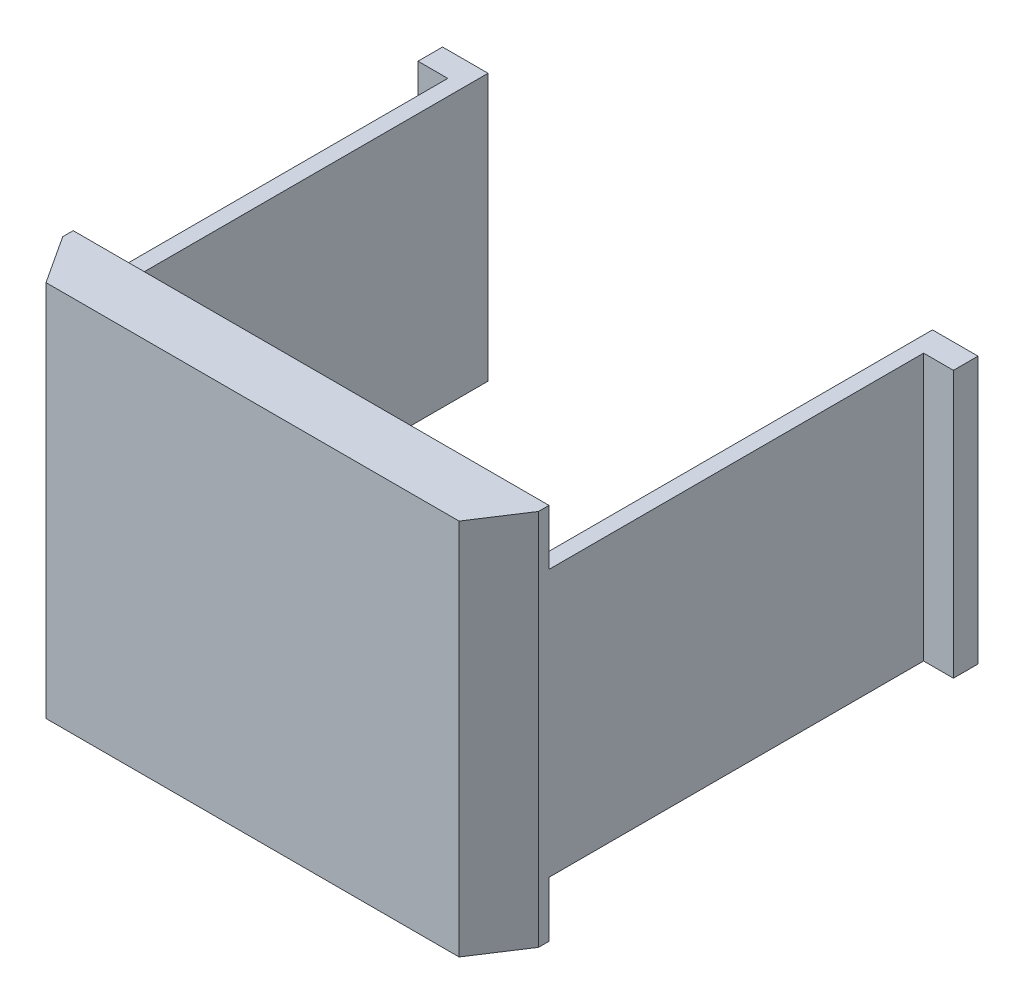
ISO-10303-21;
HEADER;
FILE_DESCRIPTION(('STEP AP214'),'2;1');
FILE_NAME('part.step','',(''),(''),'','','');
FILE_SCHEMA(('AUTOMOTIVE_DESIGN { 1 0 10303 214 1 1 1 1 }'));
ENDSEC;
DATA;
#1=APPLICATION_CONTEXT('core data for automotive mechanical design processes');
#2=APPLICATION_PROTOCOL_DEFINITION('international standard','automotive_design',2000,#1);
#3=PRODUCT_CONTEXT('',#1,'mechanical');
#4=PRODUCT('Part','Part','',(#3));
#5=PRODUCT_RELATED_PRODUCT_CATEGORY('part','',(#4));
#6=PRODUCT_DEFINITION_FORMATION('','',#4);
#7=PRODUCT_DEFINITION_CONTEXT('part definition',#1,'design');
#8=PRODUCT_DEFINITION('design','',#6,#7);
#9=PRODUCT_DEFINITION_SHAPE('','',#8);
#10=(LENGTH_UNIT() NAMED_UNIT(*) SI_UNIT(.MILLI.,.METRE.));
#11=(NAMED_UNIT(*) PLANE_ANGLE_UNIT() SI_UNIT($,.RADIAN.));
#12=(NAMED_UNIT(*) SI_UNIT($,.STERADIAN.) SOLID_ANGLE_UNIT());
#13=UNCERTAINTY_MEASURE_WITH_UNIT(LENGTH_MEASURE(1.E-05),#10,'distance_accuracy_value','');
#14=(GEOMETRIC_REPRESENTATION_CONTEXT(3) GLOBAL_UNCERTAINTY_ASSIGNED_CONTEXT((#13)) GLOBAL_UNIT_ASSIGNED_CONTEXT((#10,
#11,#12)) REPRESENTATION_CONTEXT('',''));
#15=CARTESIAN_POINT('',(0.,0.,0.));
#16=DIRECTION('',(0.,0.,1.));
#17=DIRECTION('',(1.,0.,0.));
#18=AXIS2_PLACEMENT_3D('',#15,#16,#17);
#19=CARTESIAN_POINT('',(-1.5,0.,0.));
#20=DIRECTION('',(1.,0.,0.));
#21=DIRECTION('',(0.,1.,0.));
#22=AXIS2_PLACEMENT_3D('',#19,#20,#21);
#23=PLANE('',#22);
#24=DIRECTION('',(0.,0.,1.));
#25=VECTOR('',#24,1.);
#26=CARTESIAN_POINT('',(-1.5,-1.5,5.6));
#27=LINE('',#26,#25);
#28=CARTESIAN_POINT('',(-1.5,-1.5,0.));
#29=VERTEX_POINT('',#28);
#30=CARTESIAN_POINT('',(-1.5,-1.5,0.999999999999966));
#31=VERTEX_POINT('',#30);
#32=EDGE_CURVE('E329',#29,#31,#27,.T.);
#33=ORIENTED_EDGE('',*,*,#32,.T.);
#34=DIRECTION('',(0.,1.,0.));
#35=VECTOR('',#34,1.);
#36=CARTESIAN_POINT('',(-1.5,34.6,0.999999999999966));
#37=LINE('',#36,#35);
#38=CARTESIAN_POINT('',(-1.5,34.6,0.999999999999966));
#39=VERTEX_POINT('',#38);
#40=EDGE_CURVE('E404',#31,#39,#37,.T.);
#41=ORIENTED_EDGE('',*,*,#40,.T.);
#42=DIRECTION('',(0.,0.,1.));
#43=VECTOR('',#42,1.);
#44=CARTESIAN_POINT('',(-1.5,34.6,5.6));
#45=LINE('',#44,#43);
#46=CARTESIAN_POINT('',(-1.5,34.6,0.));
#47=VERTEX_POINT('',#46);
#48=EDGE_CURVE('E305',#47,#39,#45,.T.);
#49=ORIENTED_EDGE('',*,*,#48,.F.);
#50=DIRECTION('',(0.,-1.,0.));
#51=VECTOR('',#50,1.);
#52=CARTESIAN_POINT('',(-1.5,-1.5,0.));
#53=LINE('',#52,#51);
#54=CARTESIAN_POINT('',(-1.49999999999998,29.3,0.));
#55=VERTEX_POINT('',#54);
#56=EDGE_CURVE('E326',#47,#55,#53,.T.);
#57=ORIENTED_EDGE('',*,*,#56,.T.);
#58=DIRECTION('',(0.,0.,1.));
#59=VECTOR('',#58,1.);
#60=CARTESIAN_POINT('',(-1.49999999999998,29.3,-38.17));
#61=LINE('',#60,#59);
#62=CARTESIAN_POINT('',(-1.5,29.3,-35.82));
#63=VERTEX_POINT('',#62);
#64=EDGE_CURVE('E249',#63,#55,#61,.T.);
#65=ORIENTED_EDGE('',*,*,#64,.F.);
#66=DIRECTION('',(0.,1.,0.));
#67=VECTOR('',#66,1.);
#68=CARTESIAN_POINT('',(-1.5,29.3,-35.82));
#69=LINE('',#68,#67);
#70=CARTESIAN_POINT('',(-1.49999999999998,3.80000000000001,-35.82));
#71=VERTEX_POINT('',#70);
#72=EDGE_CURVE('E234',#71,#63,#69,.T.);
#73=ORIENTED_EDGE('',*,*,#72,.F.);
#74=DIRECTION('',(0.,0.,1.));
#75=VECTOR('',#74,1.);
#76=CARTESIAN_POINT('',(-1.49999999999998,3.80000000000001,-38.17));
#77=LINE('',#76,#75);
#78=CARTESIAN_POINT('',(-1.5,3.8,0.));
#79=VERTEX_POINT('',#78);
#80=EDGE_CURVE('E254',#71,#79,#77,.T.);
#81=ORIENTED_EDGE('',*,*,#80,.T.);
#82=EDGE_CURVE('E330',#79,#29,#53,.T.);
#83=ORIENTED_EDGE('',*,*,#82,.T.);
#84=EDGE_LOOP('',(#33,#41,#49,#57,#65,#73,#81,#83));
#85=FACE_BOUND('',#84,.T.);
#86=ADVANCED_FACE('F36',(#85),#23,.F.);
#87=CARTESIAN_POINT('',(42.5,-1.49999999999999,0.));
#88=DIRECTION('',(0.,0.,1.));
#89=DIRECTION('',(1.,0.,0.));
#90=AXIS2_PLACEMENT_3D('',#87,#88,#89);
#91=PLANE('',#90);
#92=DIRECTION('',(1.,0.,0.));
#93=VECTOR('',#92,1.);
#94=CARTESIAN_POINT('',(0.,29.3,0.));
#95=LINE('',#94,#93);
#96=CARTESIAN_POINT('',(0.,29.3,0.));
#97=VERTEX_POINT('',#96);
#98=EDGE_CURVE('E245',#55,#97,#95,.T.);
#99=ORIENTED_EDGE('',*,*,#98,.F.);
#100=ORIENTED_EDGE('',*,*,#56,.F.);
#101=DIRECTION('',(-1.,0.,0.));
#102=VECTOR('',#101,1.);
#103=CARTESIAN_POINT('',(-1.5,34.6,0.));
#104=LINE('',#103,#102);
#105=CARTESIAN_POINT('',(44.,34.6,0.));
#106=VERTEX_POINT('',#105);
#107=EDGE_CURVE('E302',#106,#47,#104,.T.);
#108=ORIENTED_EDGE('',*,*,#107,.F.);
#109=DIRECTION('',(0.,1.,0.));
#110=VECTOR('',#109,1.);
#111=CARTESIAN_POINT('',(44.,33.1,0.));
#112=LINE('',#111,#110);
#113=CARTESIAN_POINT('',(44.,29.3,0.));
#114=VERTEX_POINT('',#113);
#115=EDGE_CURVE('E316',#114,#106,#112,.T.);
#116=ORIENTED_EDGE('',*,*,#115,.F.);
#117=DIRECTION('',(1.,0.,0.));
#118=VECTOR('',#117,1.);
#119=CARTESIAN_POINT('',(44.,29.3,0.));
#120=LINE('',#119,#118);
#121=CARTESIAN_POINT('',(42.5,29.3,0.));
#122=VERTEX_POINT('',#121);
#123=EDGE_CURVE('E283',#122,#114,#120,.T.);
#124=ORIENTED_EDGE('',*,*,#123,.F.);
#125=DIRECTION('',(0.,1.,0.));
#126=VECTOR('',#125,1.);
#127=CARTESIAN_POINT('',(42.5,33.1,0.));
#128=LINE('',#127,#126);
#129=CARTESIAN_POINT('',(42.5,33.1,0.));
#130=VERTEX_POINT('',#129);
#131=EDGE_CURVE('E324',#122,#130,#128,.T.);
#132=ORIENTED_EDGE('',*,*,#131,.T.);
#133=DIRECTION('',(-1.,0.,0.));
#134=VECTOR('',#133,1.);
#135=CARTESIAN_POINT('',(-1.5,33.1,0.));
#136=LINE('',#135,#134);
#137=CARTESIAN_POINT('',(0.,33.1,0.));
#138=VERTEX_POINT('',#137);
#139=EDGE_CURVE('E301',#130,#138,#136,.T.);
#140=ORIENTED_EDGE('',*,*,#139,.T.);
#141=DIRECTION('',(0.,-1.,0.));
#142=VECTOR('',#141,1.);
#143=CARTESIAN_POINT('',(0.,-1.5,0.));
#144=LINE('',#143,#142);
#145=EDGE_CURVE('E337',#138,#97,#144,.T.);
#146=ORIENTED_EDGE('',*,*,#145,.T.);
#147=EDGE_LOOP('',(#99,#100,#108,#116,#124,#132,#140,#146));
#148=FACE_BOUND('',#147,.T.);
#149=ADVANCED_FACE('F420',(#148),#91,.F.);
#150=DIRECTION('',(-1.,0.,0.));
#151=VECTOR('',#150,1.);
#152=CARTESIAN_POINT('',(-1.49999999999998,3.80000000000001,0.));
#153=LINE('',#152,#151);
#154=CARTESIAN_POINT('',(0.,3.8,0.));
#155=VERTEX_POINT('',#154);
#156=EDGE_CURVE('E219',#155,#79,#153,.T.);
#157=ORIENTED_EDGE('',*,*,#156,.F.);
#158=CARTESIAN_POINT('',(0.,0.,0.));
#159=VERTEX_POINT('',#158);
#160=EDGE_CURVE('E336',#155,#159,#144,.T.);
#161=ORIENTED_EDGE('',*,*,#160,.T.);
#162=DIRECTION('',(1.,0.,0.));
#163=VECTOR('',#162,1.);
#164=CARTESIAN_POINT('',(42.5,0.,0.));
#165=LINE('',#164,#163);
#166=CARTESIAN_POINT('',(42.5,0.,0.));
#167=VERTEX_POINT('',#166);
#168=EDGE_CURVE('E349',#159,#167,#165,.T.);
#169=ORIENTED_EDGE('',*,*,#168,.T.);
#170=CARTESIAN_POINT('',(42.5,3.8,0.));
#171=VERTEX_POINT('',#170);
#172=EDGE_CURVE('E317',#167,#171,#128,.T.);
#173=ORIENTED_EDGE('',*,*,#172,.T.);
#174=DIRECTION('',(-1.,0.,0.));
#175=VECTOR('',#174,1.);
#176=CARTESIAN_POINT('',(42.5,3.8,0.));
#177=LINE('',#176,#175);
#178=CARTESIAN_POINT('',(44.,3.8,0.));
#179=VERTEX_POINT('',#178);
#180=EDGE_CURVE('E278',#179,#171,#177,.T.);
#181=ORIENTED_EDGE('',*,*,#180,.F.);
#182=CARTESIAN_POINT('',(44.,-1.5,0.));
#183=VERTEX_POINT('',#182);
#184=EDGE_CURVE('E318',#183,#179,#112,.T.);
#185=ORIENTED_EDGE('',*,*,#184,.F.);
#186=DIRECTION('',(1.,0.,0.));
#187=VECTOR('',#186,1.);
#188=CARTESIAN_POINT('',(42.5,-1.49999999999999,0.));
#189=LINE('',#188,#187);
#190=EDGE_CURVE('E340',#29,#183,#189,.T.);
#191=ORIENTED_EDGE('',*,*,#190,.F.);
#192=ORIENTED_EDGE('',*,*,#82,.F.);
#193=EDGE_LOOP('',(#157,#161,#169,#173,#181,#185,#191,#192));
#194=FACE_BOUND('',#193,.T.);
#195=ADVANCED_FACE('F432',(#194),#91,.F.);
#196=CARTESIAN_POINT('',(44.,0.,0.));
#197=DIRECTION('',(-1.,0.,0.));
#198=DIRECTION('',(0.,-1.,0.));
#199=AXIS2_PLACEMENT_3D('',#196,#197,#198);
#200=PLANE('',#199);
#201=DIRECTION('',(0.,0.,-1.));
#202=VECTOR('',#201,1.);
#203=CARTESIAN_POINT('',(44.,34.6,0.));
#204=LINE('',#203,#202);
#205=CARTESIAN_POINT('',(44.,34.6,1.00000000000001));
#206=VERTEX_POINT('',#205);
#207=EDGE_CURVE('E309',#206,#106,#204,.T.);
#208=ORIENTED_EDGE('',*,*,#207,.F.);
#209=DIRECTION('',(0.,-1.,0.));
#210=VECTOR('',#209,1.);
#211=CARTESIAN_POINT('',(44.,-1.5,1.00000000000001));
#212=LINE('',#211,#210);
#213=CARTESIAN_POINT('',(44.,-1.5,1.00000000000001));
#214=VERTEX_POINT('',#213);
#215=EDGE_CURVE('E388',#206,#214,#212,.T.);
#216=ORIENTED_EDGE('',*,*,#215,.T.);
#217=DIRECTION('',(0.,0.,-1.));
#218=VECTOR('',#217,1.);
#219=CARTESIAN_POINT('',(44.,-1.5,0.));
#220=LINE('',#219,#218);
#221=EDGE_CURVE('E314',#214,#183,#220,.T.);
#222=ORIENTED_EDGE('',*,*,#221,.T.);
#223=ORIENTED_EDGE('',*,*,#184,.T.);
#224=DIRECTION('',(0.,0.,1.));
#225=VECTOR('',#224,1.);
#226=CARTESIAN_POINT('',(44.,3.8,-38.17));
#227=LINE('',#226,#225);
#228=CARTESIAN_POINT('',(44.,3.8,-35.82));
#229=VERTEX_POINT('',#228);
#230=EDGE_CURVE('E287',#229,#179,#227,.T.);
#231=ORIENTED_EDGE('',*,*,#230,.F.);
#232=DIRECTION('',(0.,-1.,0.));
#233=VECTOR('',#232,1.);
#234=CARTESIAN_POINT('',(44.,3.8,-35.82));
#235=LINE('',#234,#233);
#236=CARTESIAN_POINT('',(44.,29.3,-35.82));
#237=VERTEX_POINT('',#236);
#238=EDGE_CURVE('E259',#237,#229,#235,.T.);
#239=ORIENTED_EDGE('',*,*,#238,.F.);
#240=DIRECTION('',(0.,0.,1.));
#241=VECTOR('',#240,1.);
#242=CARTESIAN_POINT('',(44.,29.3,-38.17));
#243=LINE('',#242,#241);
#244=EDGE_CURVE('E293',#237,#114,#243,.T.);
#245=ORIENTED_EDGE('',*,*,#244,.T.);
#246=ORIENTED_EDGE('',*,*,#115,.T.);
#247=EDGE_LOOP('',(#208,#216,#222,#223,#231,#239,#245,#246));
#248=FACE_BOUND('',#247,.T.);
#249=ADVANCED_FACE('F480',(#248),#200,.F.);
#250=CARTESIAN_POINT('',(0.,0.,5.6));
#251=DIRECTION('',(0.,0.,1.));
#252=DIRECTION('',(1.,0.,0.));
#253=AXIS2_PLACEMENT_3D('',#250,#251,#252);
#254=PLANE('',#253);
#255=DIRECTION('',(1.,0.,0.));
#256=VECTOR('',#255,1.);
#257=CARTESIAN_POINT('',(44.,34.6,5.6));
#258=LINE('',#257,#256);
#259=CARTESIAN_POINT('',(1.49999999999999,34.6,5.6));
#260=VERTEX_POINT('',#259);
#261=CARTESIAN_POINT('',(41.,34.6,5.6));
#262=VERTEX_POINT('',#261);
#263=EDGE_CURVE('E307',#260,#262,#258,.T.);
#264=ORIENTED_EDGE('',*,*,#263,.F.);
#265=DIRECTION('',(0.,-1.,0.));
#266=VECTOR('',#265,1.);
#267=CARTESIAN_POINT('',(1.5,-1.5,5.6));
#268=LINE('',#267,#266);
#269=CARTESIAN_POINT('',(1.5,-1.49999999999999,5.6));
#270=VERTEX_POINT('',#269);
#271=EDGE_CURVE('E44',#260,#270,#268,.T.);
#272=ORIENTED_EDGE('',*,*,#271,.T.);
#273=DIRECTION('',(-1.,0.,0.));
#274=VECTOR('',#273,1.);
#275=CARTESIAN_POINT('',(0.,-1.49999999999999,5.6));
#276=LINE('',#275,#274);
#277=CARTESIAN_POINT('',(41.,-1.49999999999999,5.6));
#278=VERTEX_POINT('',#277);
#279=EDGE_CURVE('E343',#278,#270,#276,.T.);
#280=ORIENTED_EDGE('',*,*,#279,.F.);
#281=DIRECTION('',(0.,1.,0.));
#282=VECTOR('',#281,1.);
#283=CARTESIAN_POINT('',(41.,34.6,5.6));
#284=LINE('',#283,#282);
#285=EDGE_CURVE('E399',#278,#262,#284,.T.);
#286=ORIENTED_EDGE('',*,*,#285,.T.);
#287=EDGE_LOOP('',(#264,#272,#280,#286));
#288=FACE_BOUND('',#287,.T.);
#289=ADVANCED_FACE('F476',(#288),#254,.T.);
#290=CARTESIAN_POINT('',(1.50000000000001,0.,4.));
#291=DIRECTION('',(0.707106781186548,0.,-0.707106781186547));
#292=DIRECTION('',(-0.707106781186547,0.,-0.707106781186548));
#293=AXIS2_PLACEMENT_3D('',#290,#291,#292);
#294=PLANE('',#293);
#295=DIRECTION('',(-0.707106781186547,0.,-0.707106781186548));
#296=VECTOR('',#295,1.);
#297=CARTESIAN_POINT('',(1.50000000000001,33.1,4.));
#298=LINE('',#297,#296);
#299=CARTESIAN_POINT('',(1.50000000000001,33.1,4.));
#300=VERTEX_POINT('',#299);
#301=CARTESIAN_POINT('',(0.,33.1,2.49999999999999));
#302=VERTEX_POINT('',#301);
#303=EDGE_CURVE('E378',#300,#302,#298,.T.);
#304=ORIENTED_EDGE('',*,*,#303,.F.);
#305=DIRECTION('',(0.,1.,0.));
#306=VECTOR('',#305,1.);
#307=CARTESIAN_POINT('',(1.50000000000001,0.,4.));
#308=LINE('',#307,#306);
#309=CARTESIAN_POINT('',(1.50000000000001,0.,4.));
#310=VERTEX_POINT('',#309);
#311=EDGE_CURVE('E389',#310,#300,#308,.T.);
#312=ORIENTED_EDGE('',*,*,#311,.F.);
#313=DIRECTION('',(-0.707106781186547,0.,-0.707106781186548));
#314=VECTOR('',#313,1.);
#315=CARTESIAN_POINT('',(1.50000000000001,0.,4.));
#316=LINE('',#315,#314);
#317=CARTESIAN_POINT('',(0.,0.,2.49999999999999));
#318=VERTEX_POINT('',#317);
#319=EDGE_CURVE('E377',#310,#318,#316,.T.);
#320=ORIENTED_EDGE('',*,*,#319,.T.);
#321=DIRECTION('',(0.,1.,0.));
#322=VECTOR('',#321,1.);
#323=CARTESIAN_POINT('',(0.,0.,2.49999999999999));
#324=LINE('',#323,#322);
#325=EDGE_CURVE('E386',#318,#302,#324,.T.);
#326=ORIENTED_EDGE('',*,*,#325,.T.);
#327=EDGE_LOOP('',(#304,#312,#320,#326));
#328=FACE_BOUND('',#327,.T.);
#329=ADVANCED_FACE('F479',(#328),#294,.T.);
#330=CARTESIAN_POINT('',(42.5,0.,2.5));
#331=DIRECTION('',(-0.707106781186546,0.,-0.707106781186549));
#332=DIRECTION('',(-0.707106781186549,0.,0.707106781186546));
#333=AXIS2_PLACEMENT_3D('',#330,#331,#332);
#334=PLANE('',#333);
#335=DIRECTION('',(-0.707106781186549,0.,0.707106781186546));
#336=VECTOR('',#335,1.);
#337=CARTESIAN_POINT('',(42.5,33.1,2.5));
#338=LINE('',#337,#336);
#339=CARTESIAN_POINT('',(42.5,33.1,2.5));
#340=VERTEX_POINT('',#339);
#341=CARTESIAN_POINT('',(41.,33.1,4.));
#342=VERTEX_POINT('',#341);
#343=EDGE_CURVE('E365',#340,#342,#338,.T.);
#344=ORIENTED_EDGE('',*,*,#343,.F.);
#345=DIRECTION('',(0.,1.,0.));
#346=VECTOR('',#345,1.);
#347=CARTESIAN_POINT('',(42.5,0.,2.5));
#348=LINE('',#347,#346);
#349=CARTESIAN_POINT('',(42.5,0.,2.5));
#350=VERTEX_POINT('',#349);
#351=EDGE_CURVE('E381',#350,#340,#348,.T.);
#352=ORIENTED_EDGE('',*,*,#351,.F.);
#353=DIRECTION('',(-0.707106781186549,0.,0.707106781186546));
#354=VECTOR('',#353,1.);
#355=CARTESIAN_POINT('',(42.5,0.,2.5));
#356=LINE('',#355,#354);
#357=CARTESIAN_POINT('',(41.,0.,4.));
#358=VERTEX_POINT('',#357);
#359=EDGE_CURVE('E374',#350,#358,#356,.T.);
#360=ORIENTED_EDGE('',*,*,#359,.T.);
#361=DIRECTION('',(0.,1.,0.));
#362=VECTOR('',#361,1.);
#363=CARTESIAN_POINT('',(41.,0.,4.));
#364=LINE('',#363,#362);
#365=EDGE_CURVE('E391',#358,#342,#364,.T.);
#366=ORIENTED_EDGE('',*,*,#365,.T.);
#367=EDGE_LOOP('',(#344,#352,#360,#366));
#368=FACE_BOUND('',#367,.T.);
#369=ADVANCED_FACE('F471',(#368),#334,.T.);
#370=CARTESIAN_POINT('',(41.,33.1,4.1));
#371=DIRECTION('',(1.,0.,0.));
#372=DIRECTION('',(0.,0.,-1.));
#373=AXIS2_PLACEMENT_3D('',#370,#371,#372);
#374=PLANE('',#373);
#375=ORIENTED_EDGE('',*,*,#365,.F.);
#376=DIRECTION('',(0.,0.,-1.));
#377=VECTOR('',#376,1.);
#378=CARTESIAN_POINT('',(41.,0.,4.1));
#379=LINE('',#378,#377);
#380=CARTESIAN_POINT('',(41.,0.,4.1));
#381=VERTEX_POINT('',#380);
#382=EDGE_CURVE('E363',#381,#358,#379,.T.);
#383=ORIENTED_EDGE('',*,*,#382,.F.);
#384=DIRECTION('',(0.,-1.,0.));
#385=VECTOR('',#384,1.);
#386=CARTESIAN_POINT('',(41.,33.1,4.1));
#387=LINE('',#386,#385);
#388=CARTESIAN_POINT('',(41.,33.1,4.1));
#389=VERTEX_POINT('',#388);
#390=EDGE_CURVE('E359',#389,#381,#387,.T.);
#391=ORIENTED_EDGE('',*,*,#390,.F.);
#392=DIRECTION('',(0.,0.,-1.));
#393=VECTOR('',#392,1.);
#394=CARTESIAN_POINT('',(41.,33.1,4.1));
#395=LINE('',#394,#393);
#396=EDGE_CURVE('E366',#389,#342,#395,.T.);
#397=ORIENTED_EDGE('',*,*,#396,.T.);
#398=EDGE_LOOP('',(#375,#383,#391,#397));
#399=FACE_BOUND('',#398,.T.);
#400=ADVANCED_FACE('F468',(#399),#374,.F.);
#401=CARTESIAN_POINT('',(1.50000000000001,0.,4.1));
#402=DIRECTION('',(-1.,0.,0.));
#403=DIRECTION('',(0.,0.,1.));
#404=AXIS2_PLACEMENT_3D('',#401,#402,#403);
#405=PLANE('',#404);
#406=ORIENTED_EDGE('',*,*,#311,.T.);
#407=DIRECTION('',(0.,0.,-1.));
#408=VECTOR('',#407,1.);
#409=CARTESIAN_POINT('',(1.50000000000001,33.1,4.1));
#410=LINE('',#409,#408);
#411=CARTESIAN_POINT('',(1.50000000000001,33.1,4.1));
#412=VERTEX_POINT('',#411);
#413=EDGE_CURVE('E369',#412,#300,#410,.T.);
#414=ORIENTED_EDGE('',*,*,#413,.F.);
#415=DIRECTION('',(0.,1.,0.));
#416=VECTOR('',#415,1.);
#417=CARTESIAN_POINT('',(1.50000000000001,0.,4.1));
#418=LINE('',#417,#416);
#419=CARTESIAN_POINT('',(1.50000000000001,0.,4.1));
#420=VERTEX_POINT('',#419);
#421=EDGE_CURVE('E355',#420,#412,#418,.T.);
#422=ORIENTED_EDGE('',*,*,#421,.F.);
#423=DIRECTION('',(0.,0.,-1.));
#424=VECTOR('',#423,1.);
#425=CARTESIAN_POINT('',(1.50000000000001,0.,4.1));
#426=LINE('',#425,#424);
#427=EDGE_CURVE('E362',#420,#310,#426,.T.);
#428=ORIENTED_EDGE('',*,*,#427,.T.);
#429=EDGE_LOOP('',(#406,#414,#422,#428));
#430=FACE_BOUND('',#429,.T.);
#431=ADVANCED_FACE('F466',(#430),#405,.F.);
#432=CARTESIAN_POINT('',(0.,0.,4.1));
#433=DIRECTION('',(0.,0.,-1.));
#434=DIRECTION('',(-1.,0.,0.));
#435=AXIS2_PLACEMENT_3D('',#432,#433,#434);
#436=PLANE('',#435);
#437=DIRECTION('',(-1.,0.,0.));
#438=VECTOR('',#437,1.);
#439=CARTESIAN_POINT('',(41.,0.,4.1));
#440=LINE('',#439,#438);
#441=EDGE_CURVE('E346',#381,#420,#440,.T.);
#442=ORIENTED_EDGE('',*,*,#441,.T.);
#443=ORIENTED_EDGE('',*,*,#421,.T.);
#444=DIRECTION('',(1.,0.,0.));
#445=VECTOR('',#444,1.);
#446=CARTESIAN_POINT('',(1.50000000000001,33.1,4.1));
#447=LINE('',#446,#445);
#448=EDGE_CURVE('E357',#412,#389,#447,.T.);
#449=ORIENTED_EDGE('',*,*,#448,.T.);
#450=ORIENTED_EDGE('',*,*,#390,.T.);
#451=EDGE_LOOP('',(#442,#443,#449,#450));
#452=FACE_BOUND('',#451,.T.);
#453=ADVANCED_FACE('F461',(#452),#436,.T.);
#454=CARTESIAN_POINT('',(0.,0.,0.));
#455=DIRECTION('',(0.,1.,0.));
#456=DIRECTION('',(0.,0.,1.));
#457=AXIS2_PLACEMENT_3D('',#454,#455,#456);
#458=PLANE('',#457);
#459=ORIENTED_EDGE('',*,*,#359,.F.);
#460=DIRECTION('',(0.,0.,1.));
#461=VECTOR('',#460,1.);
#462=CARTESIAN_POINT('',(42.5,0.,5.6));
#463=LINE('',#462,#461);
#464=EDGE_CURVE('E344',#167,#350,#463,.T.);
#465=ORIENTED_EDGE('',*,*,#464,.F.);
#466=ORIENTED_EDGE('',*,*,#168,.F.);
#467=DIRECTION('',(0.,0.,-1.));
#468=VECTOR('',#467,1.);
#469=CARTESIAN_POINT('',(0.,0.,0.));
#470=LINE('',#469,#468);
#471=EDGE_CURVE('E333',#318,#159,#470,.T.);
#472=ORIENTED_EDGE('',*,*,#471,.F.);
#473=ORIENTED_EDGE('',*,*,#319,.F.);
#474=ORIENTED_EDGE('',*,*,#427,.F.);
#475=ORIENTED_EDGE('',*,*,#441,.F.);
#476=ORIENTED_EDGE('',*,*,#382,.T.);
#477=EDGE_LOOP('',(#459,#465,#466,#472,#473,#474,#475,#476));
#478=FACE_BOUND('',#477,.T.);
#479=ADVANCED_FACE('F459',(#478),#458,.T.);
#480=CARTESIAN_POINT('',(0.,-1.49999999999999,0.));
#481=DIRECTION('',(0.,1.,0.));
#482=DIRECTION('',(0.,0.,1.));
#483=AXIS2_PLACEMENT_3D('',#480,#481,#482);
#484=PLANE('',#483);
#485=ORIENTED_EDGE('',*,*,#279,.T.);
#486=DIRECTION('',(-0.546267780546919,0.,-0.837610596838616));
#487=VECTOR('',#486,1.);
#488=CARTESIAN_POINT('',(-1.5,-1.49999999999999,0.999999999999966));
#489=LINE('',#488,#487);
#490=EDGE_CURVE('E11',#270,#31,#489,.T.);
#491=ORIENTED_EDGE('',*,*,#490,.T.);
#492=ORIENTED_EDGE('',*,*,#32,.F.);
#493=ORIENTED_EDGE('',*,*,#190,.T.);
#494=ORIENTED_EDGE('',*,*,#221,.F.);
#495=DIRECTION('',(-0.546267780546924,0.,0.837610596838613));
#496=VECTOR('',#495,1.);
#497=CARTESIAN_POINT('',(44.,-1.49999999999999,1.00000000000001));
#498=LINE('',#497,#496);
#499=EDGE_CURVE('E397',#214,#278,#498,.T.);
#500=ORIENTED_EDGE('',*,*,#499,.T.);
#501=EDGE_LOOP('',(#485,#491,#492,#493,#494,#500));
#502=FACE_BOUND('',#501,.T.);
#503=ADVANCED_FACE('F436',(#502),#484,.F.);
#504=CARTESIAN_POINT('',(0.,0.,0.));
#505=DIRECTION('',(1.,0.,0.));
#506=DIRECTION('',(0.,1.,0.));
#507=AXIS2_PLACEMENT_3D('',#504,#505,#506);
#508=PLANE('',#507);
#509=ORIENTED_EDGE('',*,*,#325,.F.);
#510=ORIENTED_EDGE('',*,*,#471,.T.);
#511=ORIENTED_EDGE('',*,*,#160,.F.);
#512=DIRECTION('',(0.,0.,1.));
#513=VECTOR('',#512,1.);
#514=CARTESIAN_POINT('',(0.,3.8,-38.17));
#515=LINE('',#514,#513);
#516=CARTESIAN_POINT('',(0.,3.8,-38.17));
#517=VERTEX_POINT('',#516);
#518=EDGE_CURVE('E256',#517,#155,#515,.T.);
#519=ORIENTED_EDGE('',*,*,#518,.F.);
#520=DIRECTION('',(0.,-1.,0.));
#521=VECTOR('',#520,1.);
#522=CARTESIAN_POINT('',(0.,3.8,-38.17));
#523=LINE('',#522,#521);
#524=CARTESIAN_POINT('',(0.,29.3,-38.17));
#525=VERTEX_POINT('',#524);
#526=EDGE_CURVE('E218',#525,#517,#523,.T.);
#527=ORIENTED_EDGE('',*,*,#526,.F.);
#528=DIRECTION('',(0.,0.,1.));
#529=VECTOR('',#528,1.);
#530=CARTESIAN_POINT('',(0.,29.3,-38.17));
#531=LINE('',#530,#529);
#532=EDGE_CURVE('E216',#525,#97,#531,.T.);
#533=ORIENTED_EDGE('',*,*,#532,.T.);
#534=ORIENTED_EDGE('',*,*,#145,.F.);
#535=DIRECTION('',(0.,0.,-1.));
#536=VECTOR('',#535,1.);
#537=CARTESIAN_POINT('',(0.,33.1,0.));
#538=LINE('',#537,#536);
#539=EDGE_CURVE('E321',#302,#138,#538,.T.);
#540=ORIENTED_EDGE('',*,*,#539,.F.);
#541=EDGE_LOOP('',(#509,#510,#511,#519,#527,#533,#534,#540));
#542=FACE_BOUND('',#541,.T.);
#543=ADVANCED_FACE('F453',(#542),#508,.T.);
#544=CARTESIAN_POINT('',(42.5,0.,0.));
#545=DIRECTION('',(-1.,0.,0.));
#546=DIRECTION('',(0.,-1.,0.));
#547=AXIS2_PLACEMENT_3D('',#544,#545,#546);
#548=PLANE('',#547);
#549=ORIENTED_EDGE('',*,*,#172,.F.);
#550=ORIENTED_EDGE('',*,*,#464,.T.);
#551=ORIENTED_EDGE('',*,*,#351,.T.);
#552=DIRECTION('',(0.,0.,1.));
#553=VECTOR('',#552,1.);
#554=CARTESIAN_POINT('',(42.5,33.1,5.6));
#555=LINE('',#554,#553);
#556=EDGE_CURVE('E311',#130,#340,#555,.T.);
#557=ORIENTED_EDGE('',*,*,#556,.F.);
#558=ORIENTED_EDGE('',*,*,#131,.F.);
#559=DIRECTION('',(0.,0.,1.));
#560=VECTOR('',#559,1.);
#561=CARTESIAN_POINT('',(42.5,29.3,-38.17));
#562=LINE('',#561,#560);
#563=CARTESIAN_POINT('',(42.5,29.3,-38.17));
#564=VERTEX_POINT('',#563);
#565=EDGE_CURVE('E295',#564,#122,#562,.T.);
#566=ORIENTED_EDGE('',*,*,#565,.F.);
#567=DIRECTION('',(0.,1.,0.));
#568=VECTOR('',#567,1.);
#569=CARTESIAN_POINT('',(42.5,29.3,-38.17));
#570=LINE('',#569,#568);
#571=CARTESIAN_POINT('',(42.5,3.8,-38.17));
#572=VERTEX_POINT('',#571);
#573=EDGE_CURVE('E282',#572,#564,#570,.T.);
#574=ORIENTED_EDGE('',*,*,#573,.F.);
#575=DIRECTION('',(0.,0.,1.));
#576=VECTOR('',#575,1.);
#577=CARTESIAN_POINT('',(42.5,3.8,-38.17));
#578=LINE('',#577,#576);
#579=EDGE_CURVE('E298',#572,#171,#578,.T.);
#580=ORIENTED_EDGE('',*,*,#579,.T.);
#581=EDGE_LOOP('',(#549,#550,#551,#557,#558,#566,#574,#580));
#582=FACE_BOUND('',#581,.T.);
#583=ADVANCED_FACE('F451',(#582),#548,.T.);
#584=CARTESIAN_POINT('',(0.,34.6,0.));
#585=DIRECTION('',(0.,-1.,0.));
#586=DIRECTION('',(0.,0.,-1.));
#587=AXIS2_PLACEMENT_3D('',#584,#585,#586);
#588=PLANE('',#587);
#589=ORIENTED_EDGE('',*,*,#48,.T.);
#590=DIRECTION('',(0.546267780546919,0.,0.837610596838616));
#591=VECTOR('',#590,1.);
#592=CARTESIAN_POINT('',(-1.5,34.6,0.999999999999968));
#593=LINE('',#592,#591);
#594=EDGE_CURVE('E58',#39,#260,#593,.T.);
#595=ORIENTED_EDGE('',*,*,#594,.T.);
#596=ORIENTED_EDGE('',*,*,#263,.T.);
#597=DIRECTION('',(0.546267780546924,0.,-0.837610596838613));
#598=VECTOR('',#597,1.);
#599=CARTESIAN_POINT('',(44.,34.6,1.));
#600=LINE('',#599,#598);
#601=EDGE_CURVE('E402',#262,#206,#600,.T.);
#602=ORIENTED_EDGE('',*,*,#601,.T.);
#603=ORIENTED_EDGE('',*,*,#207,.T.);
#604=ORIENTED_EDGE('',*,*,#107,.T.);
#605=EDGE_LOOP('',(#589,#595,#596,#602,#603,#604));
#606=FACE_BOUND('',#605,.T.);
#607=ADVANCED_FACE('F413',(#606),#588,.F.);
#608=CARTESIAN_POINT('',(0.,33.1,0.));
#609=DIRECTION('',(0.,-1.,0.));
#610=DIRECTION('',(0.,0.,-1.));
#611=AXIS2_PLACEMENT_3D('',#608,#609,#610);
#612=PLANE('',#611);
#613=ORIENTED_EDGE('',*,*,#303,.T.);
#614=ORIENTED_EDGE('',*,*,#539,.T.);
#615=ORIENTED_EDGE('',*,*,#139,.F.);
#616=ORIENTED_EDGE('',*,*,#556,.T.);
#617=ORIENTED_EDGE('',*,*,#343,.T.);
#618=ORIENTED_EDGE('',*,*,#396,.F.);
#619=ORIENTED_EDGE('',*,*,#448,.F.);
#620=ORIENTED_EDGE('',*,*,#413,.T.);
#621=EDGE_LOOP('',(#613,#614,#615,#616,#617,#618,#619,#620));
#622=FACE_BOUND('',#621,.T.);
#623=ADVANCED_FACE('F498',(#622),#612,.T.);
#624=CARTESIAN_POINT('',(42.5,3.8,-38.17));
#625=DIRECTION('',(0.,1.,0.));
#626=DIRECTION('',(-1.,0.,0.));
#627=AXIS2_PLACEMENT_3D('',#624,#625,#626);
#628=PLANE('',#627);
#629=ORIENTED_EDGE('',*,*,#180,.T.);
#630=ORIENTED_EDGE('',*,*,#579,.F.);
#631=DIRECTION('',(-1.,0.,0.));
#632=VECTOR('',#631,1.);
#633=CARTESIAN_POINT('',(42.5,3.8,-38.17));
#634=LINE('',#633,#632);
#635=CARTESIAN_POINT('',(46.85,3.8,-38.17));
#636=VERTEX_POINT('',#635);
#637=EDGE_CURVE('E279',#636,#572,#634,.T.);
#638=ORIENTED_EDGE('',*,*,#637,.F.);
#639=DIRECTION('',(0.,0.,-1.));
#640=VECTOR('',#639,1.);
#641=CARTESIAN_POINT('',(46.85,3.8,-38.17));
#642=LINE('',#641,#640);
#643=CARTESIAN_POINT('',(46.85,3.8,-35.82));
#644=VERTEX_POINT('',#643);
#645=EDGE_CURVE('E260',#644,#636,#642,.T.);
#646=ORIENTED_EDGE('',*,*,#645,.F.);
#647=DIRECTION('',(-1.,0.,0.));
#648=VECTOR('',#647,1.);
#649=CARTESIAN_POINT('',(46.85,3.8,-35.82));
#650=LINE('',#649,#648);
#651=EDGE_CURVE('E270',#644,#229,#650,.T.);
#652=ORIENTED_EDGE('',*,*,#651,.T.);
#653=ORIENTED_EDGE('',*,*,#230,.T.);
#654=EDGE_LOOP('',(#629,#630,#638,#646,#652,#653));
#655=FACE_BOUND('',#654,.T.);
#656=ADVANCED_FACE('F516',(#655),#628,.F.);
#657=CARTESIAN_POINT('',(44.,29.3,-38.17));
#658=DIRECTION('',(0.,-1.,0.));
#659=DIRECTION('',(1.,0.,0.));
#660=AXIS2_PLACEMENT_3D('',#657,#658,#659);
#661=PLANE('',#660);
#662=ORIENTED_EDGE('',*,*,#123,.T.);
#663=ORIENTED_EDGE('',*,*,#244,.F.);
#664=DIRECTION('',(-1.,0.,0.));
#665=VECTOR('',#664,1.);
#666=CARTESIAN_POINT('',(46.85,29.3,-35.82));
#667=LINE('',#666,#665);
#668=CARTESIAN_POINT('',(46.85,29.3,-35.82));
#669=VERTEX_POINT('',#668);
#670=EDGE_CURVE('E275',#669,#237,#667,.T.);
#671=ORIENTED_EDGE('',*,*,#670,.F.);
#672=DIRECTION('',(0.,0.,1.));
#673=VECTOR('',#672,1.);
#674=CARTESIAN_POINT('',(46.85,29.3,-35.82));
#675=LINE('',#674,#673);
#676=CARTESIAN_POINT('',(46.85,29.3,-38.17));
#677=VERTEX_POINT('',#676);
#678=EDGE_CURVE('E266',#677,#669,#675,.T.);
#679=ORIENTED_EDGE('',*,*,#678,.F.);
#680=DIRECTION('',(1.,0.,0.));
#681=VECTOR('',#680,1.);
#682=CARTESIAN_POINT('',(44.,29.3,-38.17));
#683=LINE('',#682,#681);
#684=EDGE_CURVE('E285',#564,#677,#683,.T.);
#685=ORIENTED_EDGE('',*,*,#684,.F.);
#686=ORIENTED_EDGE('',*,*,#565,.T.);
#687=EDGE_LOOP('',(#662,#663,#671,#679,#685,#686));
#688=FACE_BOUND('',#687,.T.);
#689=ADVANCED_FACE('F503',(#688),#661,.F.);
#690=CARTESIAN_POINT('',(0.,0.,-38.17));
#691=DIRECTION('',(0.,0.,1.));
#692=DIRECTION('',(1.,0.,0.));
#693=AXIS2_PLACEMENT_3D('',#690,#691,#692);
#694=PLANE('',#693);
#695=ORIENTED_EDGE('',*,*,#637,.T.);
#696=ORIENTED_EDGE('',*,*,#573,.T.);
#697=ORIENTED_EDGE('',*,*,#684,.T.);
#698=DIRECTION('',(0.,1.,0.));
#699=VECTOR('',#698,1.);
#700=CARTESIAN_POINT('',(46.85,29.3,-38.17));
#701=LINE('',#700,#699);
#702=EDGE_CURVE('E263',#636,#677,#701,.T.);
#703=ORIENTED_EDGE('',*,*,#702,.F.);
#704=EDGE_LOOP('',(#695,#696,#697,#703));
#705=FACE_BOUND('',#704,.T.);
#706=ADVANCED_FACE('F509',(#705),#694,.F.);
#707=CARTESIAN_POINT('',(46.85,3.8,-35.82));
#708=DIRECTION('',(0.,0.,-1.));
#709=DIRECTION('',(-1.,0.,0.));
#710=AXIS2_PLACEMENT_3D('',#707,#708,#709);
#711=PLANE('',#710);
#712=ORIENTED_EDGE('',*,*,#238,.T.);
#713=ORIENTED_EDGE('',*,*,#651,.F.);
#714=DIRECTION('',(0.,-1.,0.));
#715=VECTOR('',#714,1.);
#716=CARTESIAN_POINT('',(46.85,3.8,-35.82));
#717=LINE('',#716,#715);
#718=EDGE_CURVE('E268',#669,#644,#717,.T.);
#719=ORIENTED_EDGE('',*,*,#718,.F.);
#720=ORIENTED_EDGE('',*,*,#670,.T.);
#721=EDGE_LOOP('',(#712,#713,#719,#720));
#722=FACE_BOUND('',#721,.T.);
#723=ADVANCED_FACE('F534',(#722),#711,.F.);
#724=CARTESIAN_POINT('',(46.85,0.,0.));
#725=DIRECTION('',(-1.,0.,0.));
#726=DIRECTION('',(0.,-1.,0.));
#727=AXIS2_PLACEMENT_3D('',#724,#725,#726);
#728=PLANE('',#727);
#729=ORIENTED_EDGE('',*,*,#645,.T.);
#730=ORIENTED_EDGE('',*,*,#702,.T.);
#731=ORIENTED_EDGE('',*,*,#678,.T.);
#732=ORIENTED_EDGE('',*,*,#718,.T.);
#733=EDGE_LOOP('',(#729,#730,#731,#732));
#734=FACE_BOUND('',#733,.T.);
#735=ADVANCED_FACE('F511',(#734),#728,.F.);
#736=CARTESIAN_POINT('',(0.,29.3,-38.17));
#737=DIRECTION('',(0.,-1.,0.));
#738=DIRECTION('',(0.,0.,-1.));
#739=AXIS2_PLACEMENT_3D('',#736,#737,#738);
#740=PLANE('',#739);
#741=ORIENTED_EDGE('',*,*,#98,.T.);
#742=ORIENTED_EDGE('',*,*,#532,.F.);
#743=DIRECTION('',(1.,0.,0.));
#744=VECTOR('',#743,1.);
#745=CARTESIAN_POINT('',(0.,29.3,-38.17));
#746=LINE('',#745,#744);
#747=CARTESIAN_POINT('',(-4.35000000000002,29.3,-38.17));
#748=VERTEX_POINT('',#747);
#749=EDGE_CURVE('E209',#748,#525,#746,.T.);
#750=ORIENTED_EDGE('',*,*,#749,.F.);
#751=DIRECTION('',(0.,0.,-1.));
#752=VECTOR('',#751,1.);
#753=CARTESIAN_POINT('',(-4.35000000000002,29.3,-38.17));
#754=LINE('',#753,#752);
#755=CARTESIAN_POINT('',(-4.35000000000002,29.3,-35.82));
#756=VERTEX_POINT('',#755);
#757=EDGE_CURVE('E215',#756,#748,#754,.T.);
#758=ORIENTED_EDGE('',*,*,#757,.F.);
#759=DIRECTION('',(1.,0.,0.));
#760=VECTOR('',#759,1.);
#761=CARTESIAN_POINT('',(-4.35000000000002,29.3,-35.82));
#762=LINE('',#761,#760);
#763=EDGE_CURVE('E240',#756,#63,#762,.T.);
#764=ORIENTED_EDGE('',*,*,#763,.T.);
#765=ORIENTED_EDGE('',*,*,#64,.T.);
#766=EDGE_LOOP('',(#741,#742,#750,#758,#764,#765));
#767=FACE_BOUND('',#766,.T.);
#768=ADVANCED_FACE('F212',(#767),#740,.F.);
#769=CARTESIAN_POINT('',(-1.49999999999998,3.80000000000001,-38.17));
#770=DIRECTION('',(0.,1.,0.));
#771=DIRECTION('',(-1.,0.,0.));
#772=AXIS2_PLACEMENT_3D('',#769,#770,#771);
#773=PLANE('',#772);
#774=ORIENTED_EDGE('',*,*,#156,.T.);
#775=ORIENTED_EDGE('',*,*,#80,.F.);
#776=DIRECTION('',(1.,0.,0.));
#777=VECTOR('',#776,1.);
#778=CARTESIAN_POINT('',(-4.35000000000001,3.80000000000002,-35.82));
#779=LINE('',#778,#777);
#780=CARTESIAN_POINT('',(-4.35000000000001,3.80000000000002,-35.82));
#781=VERTEX_POINT('',#780);
#782=EDGE_CURVE('E243',#781,#71,#779,.T.);
#783=ORIENTED_EDGE('',*,*,#782,.F.);
#784=DIRECTION('',(0.,0.,1.));
#785=VECTOR('',#784,1.);
#786=CARTESIAN_POINT('',(-4.35000000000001,3.80000000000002,-35.82));
#787=LINE('',#786,#785);
#788=CARTESIAN_POINT('',(-4.35000000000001,3.80000000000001,-38.17));
#789=VERTEX_POINT('',#788);
#790=EDGE_CURVE('E228',#789,#781,#787,.T.);
#791=ORIENTED_EDGE('',*,*,#790,.F.);
#792=DIRECTION('',(-1.,0.,0.));
#793=VECTOR('',#792,1.);
#794=CARTESIAN_POINT('',(-1.49999999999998,3.80000000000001,-38.17));
#795=LINE('',#794,#793);
#796=EDGE_CURVE('E225',#517,#789,#795,.T.);
#797=ORIENTED_EDGE('',*,*,#796,.F.);
#798=ORIENTED_EDGE('',*,*,#518,.T.);
#799=EDGE_LOOP('',(#774,#775,#783,#791,#797,#798));
#800=FACE_BOUND('',#799,.T.);
#801=ADVANCED_FACE('F426',(#800),#773,.F.);
#802=CARTESIAN_POINT('',(0.,0.,-38.17));
#803=DIRECTION('',(0.,0.,1.));
#804=DIRECTION('',(1.,0.,0.));
#805=AXIS2_PLACEMENT_3D('',#802,#803,#804);
#806=PLANE('',#805);
#807=ORIENTED_EDGE('',*,*,#749,.T.);
#808=ORIENTED_EDGE('',*,*,#526,.T.);
#809=ORIENTED_EDGE('',*,*,#796,.T.);
#810=DIRECTION('',(0.,-1.,0.));
#811=VECTOR('',#810,1.);
#812=CARTESIAN_POINT('',(-4.35000000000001,3.80000000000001,-38.17));
#813=LINE('',#812,#811);
#814=EDGE_CURVE('E222',#748,#789,#813,.T.);
#815=ORIENTED_EDGE('',*,*,#814,.F.);
#816=EDGE_LOOP('',(#807,#808,#809,#815));
#817=FACE_BOUND('',#816,.T.);
#818=ADVANCED_FACE('F223',(#817),#806,.F.);
#819=CARTESIAN_POINT('',(-4.35000000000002,29.3,-35.82));
#820=DIRECTION('',(0.,0.,-1.));
#821=DIRECTION('',(-1.,0.,0.));
#822=AXIS2_PLACEMENT_3D('',#819,#820,#821);
#823=PLANE('',#822);
#824=ORIENTED_EDGE('',*,*,#72,.T.);
#825=ORIENTED_EDGE('',*,*,#763,.F.);
#826=DIRECTION('',(0.,1.,0.));
#827=VECTOR('',#826,1.);
#828=CARTESIAN_POINT('',(-4.35000000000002,29.3,-35.82));
#829=LINE('',#828,#827);
#830=EDGE_CURVE('E232',#781,#756,#829,.T.);
#831=ORIENTED_EDGE('',*,*,#830,.F.);
#832=ORIENTED_EDGE('',*,*,#782,.T.);
#833=EDGE_LOOP('',(#824,#825,#831,#832));
#834=FACE_BOUND('',#833,.T.);
#835=ADVANCED_FACE('F423',(#834),#823,.F.);
#836=CARTESIAN_POINT('',(-4.35000000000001,0.,0.));
#837=DIRECTION('',(1.,0.,0.));
#838=DIRECTION('',(0.,1.,0.));
#839=AXIS2_PLACEMENT_3D('',#836,#837,#838);
#840=PLANE('',#839);
#841=ORIENTED_EDGE('',*,*,#757,.T.);
#842=ORIENTED_EDGE('',*,*,#814,.T.);
#843=ORIENTED_EDGE('',*,*,#790,.T.);
#844=ORIENTED_EDGE('',*,*,#830,.T.);
#845=EDGE_LOOP('',(#841,#842,#843,#844));
#846=FACE_BOUND('',#845,.T.);
#847=ADVANCED_FACE('F230',(#846),#840,.F.);
#848=CARTESIAN_POINT('',(44.,0.,1.00000000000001));
#849=DIRECTION('',(0.837610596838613,0.,0.546267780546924));
#850=DIRECTION('',(0.,1.,0.));
#851=AXIS2_PLACEMENT_3D('',#848,#849,#850);
#852=PLANE('',#851);
#853=ORIENTED_EDGE('',*,*,#601,.F.);
#854=ORIENTED_EDGE('',*,*,#285,.F.);
#855=ORIENTED_EDGE('',*,*,#499,.F.);
#856=ORIENTED_EDGE('',*,*,#215,.F.);
#857=EDGE_LOOP('',(#853,#854,#855,#856));
#858=FACE_BOUND('',#857,.T.);
#859=ADVANCED_FACE('F438',(#858),#852,.T.);
#860=CARTESIAN_POINT('',(-1.5,0.,0.999999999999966));
#861=DIRECTION('',(-0.837610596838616,0.,0.546267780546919));
#862=DIRECTION('',(0.,-1.,0.));
#863=AXIS2_PLACEMENT_3D('',#860,#861,#862);
#864=PLANE('',#863);
#865=ORIENTED_EDGE('',*,*,#490,.F.);
#866=ORIENTED_EDGE('',*,*,#271,.F.);
#867=ORIENTED_EDGE('',*,*,#594,.F.);
#868=ORIENTED_EDGE('',*,*,#40,.F.);
#869=EDGE_LOOP('',(#865,#866,#867,#868));
#870=FACE_BOUND('',#869,.T.);
#871=ADVANCED_FACE('F38',(#870),#864,.T.);
#872=CLOSED_SHELL('',(#86,#149,#195,#249,#289,#329,#369,#400,#431,#453,#479,#503,#543,#583,#607,
#623,#656,#689,#706,#723,#735,#768,#801,#818,#835,#847,#859,#871));
#873=MANIFOLD_SOLID_BREP('B2',#872);
#874=ADVANCED_BREP_SHAPE_REPRESENTATION('',(#18,#873),#14);
#875=SHAPE_DEFINITION_REPRESENTATION(#9,#874);
ENDSEC;
END-ISO-10303-21;
